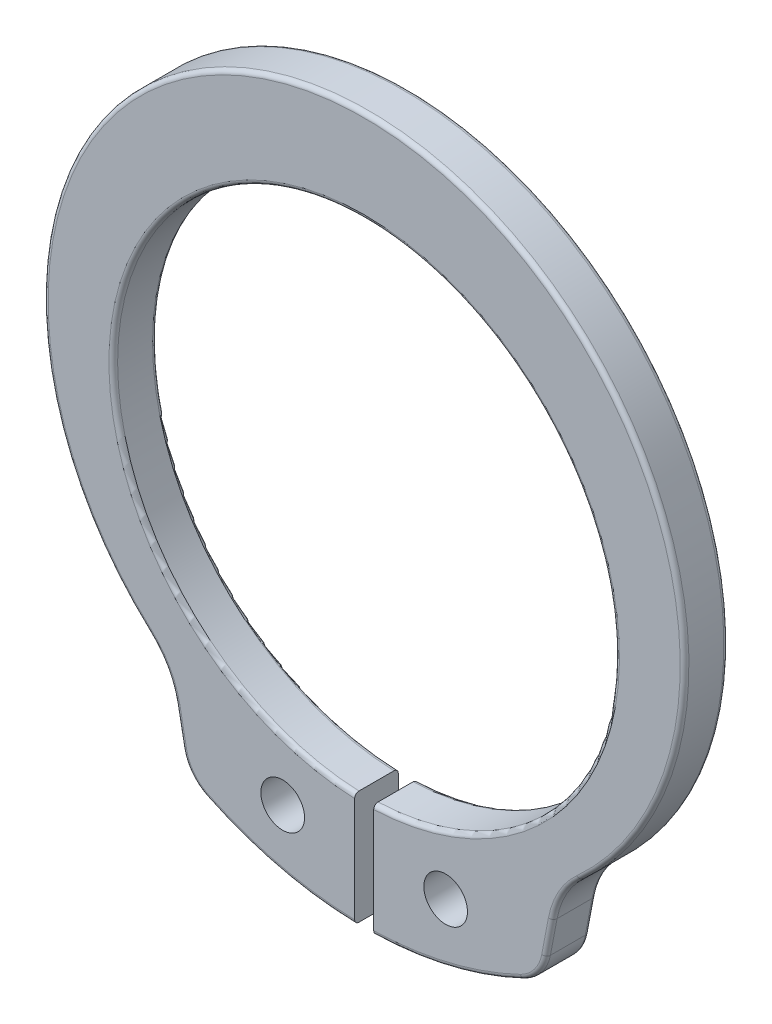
ISO-10303-21;
HEADER;
FILE_DESCRIPTION(('STEP AP214'),'2;1');
FILE_NAME('part.step','',(''),(''),'','','');
FILE_SCHEMA(('AUTOMOTIVE_DESIGN { 1 0 10303 214 1 1 1 1 }'));
ENDSEC;
DATA;
#1=APPLICATION_CONTEXT('core data for automotive mechanical design processes');
#2=APPLICATION_PROTOCOL_DEFINITION('international standard','automotive_design',2000,#1);
#3=PRODUCT_CONTEXT('',#1,'mechanical');
#4=PRODUCT('Part','Part','',(#3));
#5=PRODUCT_RELATED_PRODUCT_CATEGORY('part','',(#4));
#6=PRODUCT_DEFINITION_FORMATION('','',#4);
#7=PRODUCT_DEFINITION_CONTEXT('part definition',#1,'design');
#8=PRODUCT_DEFINITION('design','',#6,#7);
#9=PRODUCT_DEFINITION_SHAPE('','',#8);
#10=(LENGTH_UNIT() NAMED_UNIT(*) SI_UNIT(.MILLI.,.METRE.));
#11=(NAMED_UNIT(*) PLANE_ANGLE_UNIT() SI_UNIT($,.RADIAN.));
#12=(NAMED_UNIT(*) SI_UNIT($,.STERADIAN.) SOLID_ANGLE_UNIT());
#13=UNCERTAINTY_MEASURE_WITH_UNIT(LENGTH_MEASURE(1.E-05),#10,'distance_accuracy_value','');
#14=(GEOMETRIC_REPRESENTATION_CONTEXT(3) GLOBAL_UNCERTAINTY_ASSIGNED_CONTEXT((#13)) GLOBAL_UNIT_ASSIGNED_CONTEXT((#10,
#11,#12)) REPRESENTATION_CONTEXT('',''));
#15=CARTESIAN_POINT('',(0.,0.,0.));
#16=DIRECTION('',(0.,0.,1.));
#17=DIRECTION('',(1.,0.,0.));
#18=AXIS2_PLACEMENT_3D('',#15,#16,#17);
#19=CARTESIAN_POINT('',(0.,0.670296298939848,0.635));
#20=DIRECTION('',(0.,0.,1.));
#21=DIRECTION('',(1.,0.,0.));
#22=AXIS2_PLACEMENT_3D('',#19,#20,#21);
#23=PLANE('',#22);
#24=DIRECTION('',(0.,1.,0.));
#25=VECTOR('',#24,1.);
#26=CARTESIAN_POINT('',(0.277688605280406,-10.6045,0.635));
#27=LINE('',#26,#25);
#28=CARTESIAN_POINT('',(0.277688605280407,-10.4774559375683,0.635));
#29=VERTEX_POINT('',#28);
#30=CARTESIAN_POINT('',(0.277688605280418,-7.42430867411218,0.635));
#31=VERTEX_POINT('',#30);
#32=EDGE_CURVE('E421',#29,#31,#27,.T.);
#33=ORIENTED_EDGE('',*,*,#32,.F.);
#34=CARTESIAN_POINT('',(0.,0.,0.635));
#35=DIRECTION('',(0.,0.,1.));
#36=DIRECTION('',(1.,0.,0.));
#37=AXIS2_PLACEMENT_3D('',#34,#35,#36);
#38=CIRCLE('',#37,10.4811351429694);
#39=CARTESIAN_POINT('',(4.53912560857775,-9.44725000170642,0.635));
#40=VERTEX_POINT('',#39);
#41=EDGE_CURVE('E57',#29,#40,#38,.T.);
#42=ORIENTED_EDGE('',*,*,#41,.T.);
#43=CARTESIAN_POINT('',(4.04412001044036,-8.41699835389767,0.635));
#44=DIRECTION('',(0.,0.,1.));
#45=DIRECTION('',(1.,0.,0.));
#46=AXIS2_PLACEMENT_3D('',#43,#44,#45);
#47=CIRCLE('',#46,1.143);
#48=CARTESIAN_POINT('',(5.16689993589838,-8.63104096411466,0.635));
#49=VERTEX_POINT('',#48);
#50=EDGE_CURVE('E61',#40,#49,#47,.T.);
#51=ORIENTED_EDGE('',*,*,#50,.T.);
#52=DIRECTION('',(-0.187263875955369,-0.982309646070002,0.));
#53=VECTOR('',#52,1.);
#54=CARTESIAN_POINT('',(5.36177125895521,-7.60882576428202,0.635));
#55=LINE('',#54,#53);
#56=CARTESIAN_POINT('',(5.36177125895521,-7.60882576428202,0.635));
#57=VERTEX_POINT('',#56);
#58=EDGE_CURVE('E584',#49,#57,#55,.F.);
#59=ORIENTED_EDGE('',*,*,#58,.T.);
#60=CARTESIAN_POINT('',(7.98159108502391,-8.10825852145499,0.635));
#61=DIRECTION('',(0.,0.,1.));
#62=DIRECTION('',(1.,0.,0.));
#63=AXIS2_PLACEMENT_3D('',#60,#61,#62);
#64=CIRCLE('',#63,2.667);
#65=CARTESIAN_POINT('',(6.18743900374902,-6.13495993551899,0.635));
#66=VERTEX_POINT('',#65);
#67=EDGE_CURVE('E489',#57,#66,#64,.F.);
#68=ORIENTED_EDGE('',*,*,#67,.T.);
#69=CARTESIAN_POINT('',(0.,0.670296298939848,0.635));
#70=DIRECTION('',(0.,0.,1.));
#71=DIRECTION('',(1.,0.,0.));
#72=AXIS2_PLACEMENT_3D('',#69,#70,#71);
#73=CIRCLE('',#72,9.19760370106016);
#74=CARTESIAN_POINT('',(-6.18743900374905,-6.13495993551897,0.635));
#75=VERTEX_POINT('',#74);
#76=EDGE_CURVE('E581',#66,#75,#73,.T.);
#77=ORIENTED_EDGE('',*,*,#76,.T.);
#78=CARTESIAN_POINT('',(-7.98159108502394,-8.10825852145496,0.635));
#79=DIRECTION('',(0.,0.,1.));
#80=DIRECTION('',(1.,0.,0.));
#81=AXIS2_PLACEMENT_3D('',#78,#79,#80);
#82=CIRCLE('',#81,2.667);
#83=CARTESIAN_POINT('',(-5.36177125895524,-7.608825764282,0.635));
#84=VERTEX_POINT('',#83);
#85=EDGE_CURVE('E579',#75,#84,#82,.F.);
#86=ORIENTED_EDGE('',*,*,#85,.T.);
#87=DIRECTION('',(0.187263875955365,-0.982309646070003,0.));
#88=VECTOR('',#87,1.);
#89=CARTESIAN_POINT('',(-5.16689993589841,-8.63104096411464,0.635));
#90=LINE('',#89,#88);
#91=CARTESIAN_POINT('',(-5.16689993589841,-8.63104096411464,0.635));
#92=VERTEX_POINT('',#91);
#93=EDGE_CURVE('E535',#84,#92,#90,.T.);
#94=ORIENTED_EDGE('',*,*,#93,.T.);
#95=CARTESIAN_POINT('',(-4.0441200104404,-8.41699835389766,0.635));
#96=DIRECTION('',(0.,0.,1.));
#97=DIRECTION('',(1.,0.,0.));
#98=AXIS2_PLACEMENT_3D('',#95,#96,#97);
#99=CIRCLE('',#98,1.143);
#100=CARTESIAN_POINT('',(-4.53912560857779,-9.4472500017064,0.635));
#101=VERTEX_POINT('',#100);
#102=EDGE_CURVE('E571',#92,#101,#99,.T.);
#103=ORIENTED_EDGE('',*,*,#102,.T.);
#104=CARTESIAN_POINT('',(0.,0.,0.635));
#105=DIRECTION('',(0.,0.,1.));
#106=DIRECTION('',(1.,0.,0.));
#107=AXIS2_PLACEMENT_3D('',#104,#105,#106);
#108=CIRCLE('',#107,10.4811351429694);
#109=CARTESIAN_POINT('',(-0.277688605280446,-10.4774559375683,0.635));
#110=VERTEX_POINT('',#109);
#111=EDGE_CURVE('E230',#101,#110,#108,.T.);
#112=ORIENTED_EDGE('',*,*,#111,.T.);
#113=DIRECTION('',(0.,1.,0.));
#114=VECTOR('',#113,1.);
#115=CARTESIAN_POINT('',(-0.277688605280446,-10.6045,0.635));
#116=LINE('',#115,#114);
#117=CARTESIAN_POINT('',(-0.277688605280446,-7.42430867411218,0.635));
#118=VERTEX_POINT('',#117);
#119=EDGE_CURVE('E391',#110,#118,#116,.T.);
#120=ORIENTED_EDGE('',*,*,#119,.T.);
#121=CARTESIAN_POINT('',(0.,0.,0.635));
#122=DIRECTION('',(0.,0.,1.));
#123=DIRECTION('',(1.,0.,0.));
#124=AXIS2_PLACEMENT_3D('',#121,#122,#123);
#125=CIRCLE('',#124,7.4295);
#126=EDGE_CURVE('E566',#118,#31,#125,.F.);
#127=ORIENTED_EDGE('',*,*,#126,.T.);
#128=EDGE_LOOP('',(#33,#42,#51,#59,#68,#77,#86,#94,#103,#112,#120,#127));
#129=FACE_BOUND('',#128,.T.);
#130=CARTESIAN_POINT('',(-2.37112029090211,-8.63571082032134,0.635));
#131=DIRECTION('',(0.,0.,1.));
#132=DIRECTION('',(1.,0.,0.));
#133=AXIS2_PLACEMENT_3D('',#130,#131,#132);
#134=CIRCLE('',#133,0.635);
#135=CARTESIAN_POINT('',(-1.73612029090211,-8.63571082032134,0.635));
#136=VERTEX_POINT('',#135);
#137=EDGE_CURVE('E395',#136,#136,#134,.T.);
#138=ORIENTED_EDGE('',*,*,#137,.F.);
#139=EDGE_LOOP('',(#138));
#140=FACE_BOUND('',#139,.T.);
#141=CARTESIAN_POINT('',(2.37112029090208,-8.63571082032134,0.635));
#142=DIRECTION('',(0.,0.,-1.));
#143=DIRECTION('',(-1.,0.,0.));
#144=AXIS2_PLACEMENT_3D('',#141,#142,#143);
#145=CIRCLE('',#144,0.635);
#146=CARTESIAN_POINT('',(1.73612029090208,-8.63571082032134,0.635));
#147=VERTEX_POINT('',#146);
#148=EDGE_CURVE('E425',#147,#147,#145,.T.);
#149=ORIENTED_EDGE('',*,*,#148,.T.);
#150=EDGE_LOOP('',(#149));
#151=FACE_BOUND('',#150,.T.);
#152=ADVANCED_FACE('F39',(#129,#140,#151),#23,.T.);
#153=CARTESIAN_POINT('',(0.,0.670296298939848,-0.635));
#154=DIRECTION('',(0.,0.,1.));
#155=DIRECTION('',(1.,0.,0.));
#156=AXIS2_PLACEMENT_3D('',#153,#154,#155);
#157=PLANE('',#156);
#158=DIRECTION('',(0.,1.,0.));
#159=VECTOR('',#158,1.);
#160=CARTESIAN_POINT('',(-0.277688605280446,-10.6045,-0.635));
#161=LINE('',#160,#159);
#162=CARTESIAN_POINT('',(-0.277688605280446,-10.4774559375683,-0.635));
#163=VERTEX_POINT('',#162);
#164=CARTESIAN_POINT('',(-0.277688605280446,-7.42430867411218,-0.635));
#165=VERTEX_POINT('',#164);
#166=EDGE_CURVE('E392',#163,#165,#161,.T.);
#167=ORIENTED_EDGE('',*,*,#166,.F.);
#168=CARTESIAN_POINT('',(0.,0.,-0.635));
#169=DIRECTION('',(0.,0.,1.));
#170=DIRECTION('',(1.,0.,0.));
#171=AXIS2_PLACEMENT_3D('',#168,#169,#170);
#172=CIRCLE('',#171,10.4811351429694);
#173=CARTESIAN_POINT('',(-4.53912560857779,-9.4472500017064,-0.635));
#174=VERTEX_POINT('',#173);
#175=EDGE_CURVE('E239',#163,#174,#172,.F.);
#176=ORIENTED_EDGE('',*,*,#175,.T.);
#177=CARTESIAN_POINT('',(-4.0441200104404,-8.41699835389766,-0.635));
#178=DIRECTION('',(0.,0.,1.));
#179=DIRECTION('',(1.,0.,0.));
#180=AXIS2_PLACEMENT_3D('',#177,#178,#179);
#181=CIRCLE('',#180,1.143);
#182=CARTESIAN_POINT('',(-5.16689993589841,-8.63104096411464,-0.635));
#183=VERTEX_POINT('',#182);
#184=EDGE_CURVE('E243',#174,#183,#181,.F.);
#185=ORIENTED_EDGE('',*,*,#184,.T.);
#186=DIRECTION('',(0.187263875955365,-0.982309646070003,0.));
#187=VECTOR('',#186,1.);
#188=CARTESIAN_POINT('',(-6.69669966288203,-0.606337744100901,-0.635));
#189=LINE('',#188,#187);
#190=CARTESIAN_POINT('',(-5.36177125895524,-7.608825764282,-0.635));
#191=VERTEX_POINT('',#190);
#192=EDGE_CURVE('E553',#183,#191,#189,.F.);
#193=ORIENTED_EDGE('',*,*,#192,.T.);
#194=CARTESIAN_POINT('',(-7.98159108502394,-8.10825852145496,-0.635));
#195=DIRECTION('',(0.,0.,1.));
#196=DIRECTION('',(1.,0.,0.));
#197=AXIS2_PLACEMENT_3D('',#194,#195,#196);
#198=CIRCLE('',#197,2.667);
#199=CARTESIAN_POINT('',(-6.18743900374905,-6.13495993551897,-0.635));
#200=VERTEX_POINT('',#199);
#201=EDGE_CURVE('E548',#191,#200,#198,.T.);
#202=ORIENTED_EDGE('',*,*,#201,.T.);
#203=CARTESIAN_POINT('',(0.,0.670296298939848,-0.635));
#204=DIRECTION('',(0.,0.,1.));
#205=DIRECTION('',(1.,0.,0.));
#206=AXIS2_PLACEMENT_3D('',#203,#204,#205);
#207=CIRCLE('',#206,9.19760370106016);
#208=CARTESIAN_POINT('',(6.18743900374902,-6.13495993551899,-0.635));
#209=VERTEX_POINT('',#208);
#210=EDGE_CURVE('E626',#200,#209,#207,.F.);
#211=ORIENTED_EDGE('',*,*,#210,.T.);
#212=CARTESIAN_POINT('',(7.98159108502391,-8.10825852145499,-0.635));
#213=DIRECTION('',(0.,0.,1.));
#214=DIRECTION('',(1.,0.,0.));
#215=AXIS2_PLACEMENT_3D('',#212,#213,#214);
#216=CIRCLE('',#215,2.667);
#217=CARTESIAN_POINT('',(5.36177125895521,-7.60882576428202,-0.635));
#218=VERTEX_POINT('',#217);
#219=EDGE_CURVE('E627',#209,#218,#216,.T.);
#220=ORIENTED_EDGE('',*,*,#219,.T.);
#221=DIRECTION('',(-0.187263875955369,-0.982309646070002,0.));
#222=VECTOR('',#221,1.);
#223=CARTESIAN_POINT('',(6.69669966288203,-0.606337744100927,-0.635));
#224=LINE('',#223,#222);
#225=CARTESIAN_POINT('',(5.16689993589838,-8.63104096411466,-0.635));
#226=VERTEX_POINT('',#225);
#227=EDGE_CURVE('E612',#218,#226,#224,.T.);
#228=ORIENTED_EDGE('',*,*,#227,.T.);
#229=CARTESIAN_POINT('',(4.04412001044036,-8.41699835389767,-0.635));
#230=DIRECTION('',(0.,0.,1.));
#231=DIRECTION('',(1.,0.,0.));
#232=AXIS2_PLACEMENT_3D('',#229,#230,#231);
#233=CIRCLE('',#232,1.143);
#234=CARTESIAN_POINT('',(4.53912560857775,-9.44725000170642,-0.635));
#235=VERTEX_POINT('',#234);
#236=EDGE_CURVE('E607',#226,#235,#233,.F.);
#237=ORIENTED_EDGE('',*,*,#236,.T.);
#238=CARTESIAN_POINT('',(0.,0.,-0.635));
#239=DIRECTION('',(0.,0.,1.));
#240=DIRECTION('',(1.,0.,0.));
#241=AXIS2_PLACEMENT_3D('',#238,#239,#240);
#242=CIRCLE('',#241,10.4811351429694);
#243=CARTESIAN_POINT('',(0.277688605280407,-10.4774559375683,-0.635));
#244=VERTEX_POINT('',#243);
#245=EDGE_CURVE('E602',#235,#244,#242,.F.);
#246=ORIENTED_EDGE('',*,*,#245,.T.);
#247=DIRECTION('',(0.,1.,0.));
#248=VECTOR('',#247,1.);
#249=CARTESIAN_POINT('',(0.277688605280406,-10.6045,-0.635));
#250=LINE('',#249,#248);
#251=CARTESIAN_POINT('',(0.277688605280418,-7.42430867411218,-0.635));
#252=VERTEX_POINT('',#251);
#253=EDGE_CURVE('E422',#244,#252,#250,.T.);
#254=ORIENTED_EDGE('',*,*,#253,.T.);
#255=CARTESIAN_POINT('',(0.,0.,-0.635));
#256=DIRECTION('',(0.,0.,1.));
#257=DIRECTION('',(1.,0.,0.));
#258=AXIS2_PLACEMENT_3D('',#255,#256,#257);
#259=CIRCLE('',#258,7.4295);
#260=EDGE_CURVE('E634',#252,#165,#259,.T.);
#261=ORIENTED_EDGE('',*,*,#260,.T.);
#262=EDGE_LOOP('',(#167,#176,#185,#193,#202,#211,#220,#228,#237,#246,#254,#261));
#263=FACE_BOUND('',#262,.T.);
#264=CARTESIAN_POINT('',(-2.37112029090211,-8.63571082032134,-0.635));
#265=DIRECTION('',(0.,0.,1.));
#266=DIRECTION('',(1.,0.,0.));
#267=AXIS2_PLACEMENT_3D('',#264,#265,#266);
#268=CIRCLE('',#267,0.635);
#269=CARTESIAN_POINT('',(-1.73612029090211,-8.63571082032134,-0.635));
#270=VERTEX_POINT('',#269);
#271=EDGE_CURVE('E398',#270,#270,#268,.T.);
#272=ORIENTED_EDGE('',*,*,#271,.T.);
#273=EDGE_LOOP('',(#272));
#274=FACE_BOUND('',#273,.T.);
#275=CARTESIAN_POINT('',(2.37112029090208,-8.63571082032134,-0.635));
#276=DIRECTION('',(0.,0.,-1.));
#277=DIRECTION('',(-1.,0.,0.));
#278=AXIS2_PLACEMENT_3D('',#275,#276,#277);
#279=CIRCLE('',#278,0.635);
#280=CARTESIAN_POINT('',(1.73612029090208,-8.63571082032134,-0.635));
#281=VERTEX_POINT('',#280);
#282=EDGE_CURVE('E428',#281,#281,#279,.T.);
#283=ORIENTED_EDGE('',*,*,#282,.F.);
#284=EDGE_LOOP('',(#283));
#285=FACE_BOUND('',#284,.T.);
#286=ADVANCED_FACE('F441',(#263,#274,#285),#157,.F.);
#287=CARTESIAN_POINT('',(0.,0.670296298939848,0.635));
#288=DIRECTION('',(0.,0.,-1.));
#289=DIRECTION('',(-1.,0.,0.));
#290=AXIS2_PLACEMENT_3D('',#287,#288,#289);
#291=CYLINDRICAL_SURFACE('',#290,9.32460370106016);
#292=DIRECTION('',(0.,0.,-1.));
#293=VECTOR('',#292,1.);
#294=CARTESIAN_POINT('',(6.27287481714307,-6.22892653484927,0.635));
#295=LINE('',#294,#293);
#296=CARTESIAN_POINT('',(6.27287481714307,-6.22892653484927,-0.508));
#297=VERTEX_POINT('',#296);
#298=CARTESIAN_POINT('',(6.27287481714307,-6.22892653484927,0.508));
#299=VERTEX_POINT('',#298);
#300=EDGE_CURVE('E409',#297,#299,#295,.F.);
#301=ORIENTED_EDGE('',*,*,#300,.F.);
#302=CARTESIAN_POINT('',(0.,0.670296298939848,-0.508));
#303=DIRECTION('',(0.,0.,1.));
#304=DIRECTION('',(1.,0.,0.));
#305=AXIS2_PLACEMENT_3D('',#302,#303,#304);
#306=CIRCLE('',#305,9.32460370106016);
#307=CARTESIAN_POINT('',(-6.27287481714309,-6.22892653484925,-0.508));
#308=VERTEX_POINT('',#307);
#309=EDGE_CURVE('E256',#297,#308,#306,.T.);
#310=ORIENTED_EDGE('',*,*,#309,.T.);
#311=DIRECTION('',(0.,0.,-1.));
#312=VECTOR('',#311,1.);
#313=CARTESIAN_POINT('',(-6.27287481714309,-6.22892653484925,0.635));
#314=LINE('',#313,#312);
#315=CARTESIAN_POINT('',(-6.27287481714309,-6.22892653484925,0.508));
#316=VERTEX_POINT('',#315);
#317=EDGE_CURVE('E225',#308,#316,#314,.F.);
#318=ORIENTED_EDGE('',*,*,#317,.T.);
#319=CARTESIAN_POINT('',(0.,0.670296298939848,0.508));
#320=DIRECTION('',(0.,0.,1.));
#321=DIRECTION('',(1.,0.,0.));
#322=AXIS2_PLACEMENT_3D('',#319,#320,#321);
#323=CIRCLE('',#322,9.32460370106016);
#324=EDGE_CURVE('E254',#316,#299,#323,.F.);
#325=ORIENTED_EDGE('',*,*,#324,.T.);
#326=EDGE_LOOP('',(#301,#310,#318,#325));
#327=FACE_BOUND('',#326,.T.);
#328=ADVANCED_FACE('F443',(#327),#291,.T.);
#329=CARTESIAN_POINT('',(-5.17638824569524,-9.25945656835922,0.635));
#330=DIRECTION('',(0.982309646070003,0.187263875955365,0.));
#331=DIRECTION('',(-0.187263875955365,0.982309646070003,0.));
#332=AXIS2_PLACEMENT_3D('',#329,#330,#331);
#333=PLANE('',#332);
#334=DIRECTION('',(0.,0.,1.));
#335=VECTOR('',#334,1.);
#336=CARTESIAN_POINT('',(-5.48652458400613,-7.63260827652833,-0.635));
#337=LINE('',#336,#335);
#338=CARTESIAN_POINT('',(-5.48652458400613,-7.63260827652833,0.508));
#339=VERTEX_POINT('',#338);
#340=CARTESIAN_POINT('',(-5.48652458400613,-7.63260827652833,-0.508));
#341=VERTEX_POINT('',#340);
#342=EDGE_CURVE('E384',#339,#341,#337,.F.);
#343=ORIENTED_EDGE('',*,*,#342,.T.);
#344=DIRECTION('',(0.187263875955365,-0.982309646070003,0.));
#345=VECTOR('',#344,1.);
#346=CARTESIAN_POINT('',(-5.17638824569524,-9.25945656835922,-0.508));
#347=LINE('',#346,#345);
#348=CARTESIAN_POINT('',(-5.2916532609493,-8.65482347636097,-0.508));
#349=VERTEX_POINT('',#348);
#350=EDGE_CURVE('E248',#341,#349,#347,.T.);
#351=ORIENTED_EDGE('',*,*,#350,.T.);
#352=DIRECTION('',(0.,0.,-1.));
#353=VECTOR('',#352,1.);
#354=CARTESIAN_POINT('',(-5.2916532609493,-8.65482347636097,0.635));
#355=LINE('',#354,#353);
#356=CARTESIAN_POINT('',(-5.2916532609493,-8.65482347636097,0.508));
#357=VERTEX_POINT('',#356);
#358=EDGE_CURVE('E215',#349,#357,#355,.F.);
#359=ORIENTED_EDGE('',*,*,#358,.T.);
#360=DIRECTION('',(0.187263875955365,-0.982309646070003,0.));
#361=VECTOR('',#360,1.);
#362=CARTESIAN_POINT('',(-5.48652458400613,-7.63260827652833,0.508));
#363=LINE('',#362,#361);
#364=EDGE_CURVE('E241',#357,#339,#363,.F.);
#365=ORIENTED_EDGE('',*,*,#364,.T.);
#366=EDGE_LOOP('',(#343,#351,#359,#365));
#367=FACE_BOUND('',#366,.T.);
#368=ADVANCED_FACE('F449',(#367),#333,.F.);
#369=CARTESIAN_POINT('',(0.,0.,0.635));
#370=DIRECTION('',(0.,0.,-1.));
#371=DIRECTION('',(-1.,0.,0.));
#372=AXIS2_PLACEMENT_3D('',#369,#370,#371);
#373=CYLINDRICAL_SURFACE('',#372,10.6081351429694);
#374=DIRECTION('',(0.,0.,-1.));
#375=VECTOR('',#374,1.);
#376=CARTESIAN_POINT('',(-4.59412623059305,-9.56172240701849,0.635));
#377=LINE('',#376,#375);
#378=CARTESIAN_POINT('',(-4.59412623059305,-9.56172240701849,0.508));
#379=VERTEX_POINT('',#378);
#380=CARTESIAN_POINT('',(-4.59412623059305,-9.56172240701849,-0.508));
#381=VERTEX_POINT('',#380);
#382=EDGE_CURVE('E207',#379,#381,#377,.T.);
#383=ORIENTED_EDGE('',*,*,#382,.T.);
#384=CARTESIAN_POINT('',(0.,0.,-0.508));
#385=DIRECTION('',(0.,0.,1.));
#386=DIRECTION('',(1.,0.,0.));
#387=AXIS2_PLACEMENT_3D('',#384,#385,#386);
#388=CIRCLE('',#387,10.6081351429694);
#389=CARTESIAN_POINT('',(-0.277688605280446,-10.6045,-0.508));
#390=VERTEX_POINT('',#389);
#391=EDGE_CURVE('E214',#381,#390,#388,.T.);
#392=ORIENTED_EDGE('',*,*,#391,.T.);
#393=DIRECTION('',(0.,0.,-1.));
#394=VECTOR('',#393,1.);
#395=CARTESIAN_POINT('',(-0.277688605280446,-10.6045,0.635));
#396=LINE('',#395,#394);
#397=CARTESIAN_POINT('',(-0.277688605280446,-10.6045,0.508));
#398=VERTEX_POINT('',#397);
#399=EDGE_CURVE('E210',#398,#390,#396,.T.);
#400=ORIENTED_EDGE('',*,*,#399,.F.);
#401=CARTESIAN_POINT('',(0.,0.,0.508));
#402=DIRECTION('',(0.,0.,1.));
#403=DIRECTION('',(1.,0.,0.));
#404=AXIS2_PLACEMENT_3D('',#401,#402,#403);
#405=CIRCLE('',#404,10.6081351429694);
#406=EDGE_CURVE('E203',#398,#379,#405,.F.);
#407=ORIENTED_EDGE('',*,*,#406,.T.);
#408=EDGE_LOOP('',(#383,#392,#400,#407));
#409=FACE_BOUND('',#408,.T.);
#410=ADVANCED_FACE('F205',(#409),#373,.T.);
#411=CARTESIAN_POINT('',(-0.277688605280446,-10.6045,0.635));
#412=DIRECTION('',(-1.,0.,0.));
#413=DIRECTION('',(0.,0.,1.));
#414=AXIS2_PLACEMENT_3D('',#411,#412,#413);
#415=PLANE('',#414);
#416=ORIENTED_EDGE('',*,*,#399,.T.);
#417=CARTESIAN_POINT('',(-0.277688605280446,-10.6045,-0.508));
#418=CARTESIAN_POINT('',(-0.277688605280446,-10.6045060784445,-0.515143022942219));
#419=CARTESIAN_POINT('',(-0.277688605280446,-10.6038975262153,-0.522284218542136));
#420=CARTESIAN_POINT('',(-0.277688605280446,-10.6014960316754,-0.536359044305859));
#421=CARTESIAN_POINT('',(-0.277688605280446,-10.5997040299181,-0.543292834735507));
#422=CARTESIAN_POINT('',(-0.277688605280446,-10.5949792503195,-0.556764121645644));
#423=CARTESIAN_POINT('',(-0.277688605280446,-10.592045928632,-0.56330142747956));
#424=CARTESIAN_POINT('',(-0.277688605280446,-10.5851244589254,-0.575789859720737));
#425=CARTESIAN_POINT('',(-0.277688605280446,-10.5811364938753,-0.581741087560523));
#426=CARTESIAN_POINT('',(-0.277688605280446,-10.572217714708,-0.592890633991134));
#427=CARTESIAN_POINT('',(-0.277688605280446,-10.5672867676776,-0.598088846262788));
#428=CARTESIAN_POINT('',(-0.277688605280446,-10.5566212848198,-0.60758502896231));
#429=CARTESIAN_POINT('',(-0.277688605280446,-10.5508865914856,-0.611882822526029));
#430=CARTESIAN_POINT('',(-0.277688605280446,-10.5387748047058,-0.619456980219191));
#431=CARTESIAN_POINT('',(-0.277688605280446,-10.5323973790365,-0.622732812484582));
#432=CARTESIAN_POINT('',(-0.277688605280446,-10.5191844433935,-0.628165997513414));
#433=CARTESIAN_POINT('',(-0.277688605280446,-10.5123492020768,-0.630323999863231));
#434=CARTESIAN_POINT('',(-0.277688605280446,-10.5008029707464,-0.632925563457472));
#435=CARTESIAN_POINT('',(-0.277688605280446,-10.4961644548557,-0.633703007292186));
#436=CARTESIAN_POINT('',(-0.277688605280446,-10.4868365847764,-0.634740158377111));
#437=CARTESIAN_POINT('',(-0.277688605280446,-10.4821473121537,-0.635000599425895));
#438=CARTESIAN_POINT('',(-0.277688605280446,-10.4774559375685,-0.63500000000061));
#439=B_SPLINE_CURVE_WITH_KNOTS('',3,(#417,#418,#419,#420,#421,#422,#423,#424,#425,#426,#427,
#428,#429,#430,#431,#432,#433,#434,#435,#436,#437,#438),.UNSPECIFIED.,.F.,.F.,(4,2,2,2,2,2,2,2,
2,2,4),(0.,0.0214005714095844,0.0427841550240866,0.0641779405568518,0.0855680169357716,
0.106961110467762,0.128358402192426,0.149766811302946,0.171162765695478,0.185245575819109,
0.199308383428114),.UNSPECIFIED.);
#440=EDGE_CURVE('E349',#390,#163,#439,.T.);
#441=ORIENTED_EDGE('',*,*,#440,.T.);
#442=ORIENTED_EDGE('',*,*,#166,.T.);
#443=CARTESIAN_POINT('',(-0.277688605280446,-7.42430867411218,-0.635));
#444=CARTESIAN_POINT('',(-0.277688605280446,-7.41715513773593,-0.635006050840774));
#445=CARTESIAN_POINT('',(-0.277688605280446,-7.41000338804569,-0.634396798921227));
#446=CARTESIAN_POINT('',(-0.277688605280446,-7.39590747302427,-0.631992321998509));
#447=CARTESIAN_POINT('',(-0.277688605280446,-7.38896315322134,-0.630198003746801));
#448=CARTESIAN_POINT('',(-0.277688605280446,-7.37547128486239,-0.625466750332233));
#449=CARTESIAN_POINT('',(-0.277688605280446,-7.36892393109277,-0.622529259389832));
#450=CARTESIAN_POINT('',(-0.277688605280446,-7.35641659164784,-0.615597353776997));
#451=CARTESIAN_POINT('',(-0.277688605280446,-7.35045649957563,-0.611603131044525));
#452=CARTESIAN_POINT('',(-0.277688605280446,-7.33929370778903,-0.602671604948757));
#453=CARTESIAN_POINT('',(-0.277688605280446,-7.33409077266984,-0.597734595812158));
#454=CARTESIAN_POINT('',(-0.277688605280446,-7.32458722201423,-0.587055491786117));
#455=CARTESIAN_POINT('',(-0.277688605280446,-7.32028678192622,-0.581313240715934));
#456=CARTESIAN_POINT('',(-0.277688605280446,-7.31271407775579,-0.569191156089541));
#457=CARTESIAN_POINT('',(-0.277688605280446,-7.30944132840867,-0.562811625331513));
#458=CARTESIAN_POINT('',(-0.277688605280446,-7.30401582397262,-0.549594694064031));
#459=CARTESIAN_POINT('',(-0.277688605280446,-7.30186240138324,-0.542757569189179));
#460=CARTESIAN_POINT('',(-0.277688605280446,-7.29927510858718,-0.531231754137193));
#461=CARTESIAN_POINT('',(-0.277688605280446,-7.29850428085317,-0.526615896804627));
#462=CARTESIAN_POINT('',(-0.277688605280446,-7.29747595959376,-0.517334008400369));
#463=CARTESIAN_POINT('',(-0.277688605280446,-7.2972177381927,-0.512668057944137));
#464=CARTESIAN_POINT('',(-0.277688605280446,-7.29721832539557,-0.50800000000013));
#465=B_SPLINE_CURVE_WITH_KNOTS('',3,(#443,#444,#445,#446,#447,#448,#449,#450,#451,#452,#453,
#454,#455,#456,#457,#458,#459,#460,#461,#462,#463,#464),.UNSPECIFIED.,.F.,.F.,(4,2,2,2,2,2,2,2,
2,2,4),(0.,0.0214321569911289,0.0428479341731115,0.0642741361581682,0.0856964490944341,
0.107112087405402,0.128531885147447,0.149941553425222,0.17133843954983,0.185351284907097,
0.1993442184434),.UNSPECIFIED.);
#466=CARTESIAN_POINT('',(-0.277688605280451,-7.29721832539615,-0.508));
#467=VERTEX_POINT('',#466);
#468=EDGE_CURVE('E350',#165,#467,#465,.T.);
#469=ORIENTED_EDGE('',*,*,#468,.T.);
#470=DIRECTION('',(0.,0.,-1.));
#471=VECTOR('',#470,1.);
#472=CARTESIAN_POINT('',(-0.277688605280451,-7.29721832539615,0.635));
#473=LINE('',#472,#471);
#474=CARTESIAN_POINT('',(-0.277688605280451,-7.29721832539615,0.508));
#475=VERTEX_POINT('',#474);
#476=EDGE_CURVE('E388',#475,#467,#473,.T.);
#477=ORIENTED_EDGE('',*,*,#476,.F.);
#478=CARTESIAN_POINT('',(-0.277688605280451,-7.29721832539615,0.508));
#479=CARTESIAN_POINT('',(-0.277688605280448,-7.29721223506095,0.515141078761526));
#480=CARTESIAN_POINT('',(-0.277688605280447,-7.29782069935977,0.522280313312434));
#481=CARTESIAN_POINT('',(-0.277688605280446,-7.30022175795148,0.536351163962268));
#482=CARTESIAN_POINT('',(-0.277688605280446,-7.30201339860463,0.543282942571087));
#483=CARTESIAN_POINT('',(-0.277688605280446,-7.3067370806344,0.556750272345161));
#484=CARTESIAN_POINT('',(-0.277688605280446,-7.30966966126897,0.563285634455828));
#485=CARTESIAN_POINT('',(-0.277688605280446,-7.31658915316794,0.575770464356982));
#486=CARTESIAN_POINT('',(-0.277688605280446,-7.32057588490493,0.581720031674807));
#487=CARTESIAN_POINT('',(-0.277688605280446,-7.32949238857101,0.592867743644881));
#488=CARTESIAN_POINT('',(-0.277688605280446,-7.33442245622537,0.598065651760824));
#489=CARTESIAN_POINT('',(-0.277688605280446,-7.34508585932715,0.607561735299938));
#490=CARTESIAN_POINT('',(-0.277688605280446,-7.35081935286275,0.611859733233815));
#491=CARTESIAN_POINT('',(-0.277688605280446,-7.36293064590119,0.619436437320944));
#492=CARTESIAN_POINT('',(-0.277688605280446,-7.36930900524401,0.622714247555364));
#493=CARTESIAN_POINT('',(-0.277688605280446,-7.38252401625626,0.628151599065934));
#494=CARTESIAN_POINT('',(-0.277688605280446,-7.38936040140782,0.630311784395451));
#495=CARTESIAN_POINT('',(-0.277688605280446,-7.40091654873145,0.63291895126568));
#496=CARTESIAN_POINT('',(-0.277688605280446,-7.40556393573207,0.633698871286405));
#497=CARTESIAN_POINT('',(-0.277688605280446,-7.41490979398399,0.634739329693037));
#498=CARTESIAN_POINT('',(-0.277688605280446,-7.41960818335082,0.63500060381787));
#499=CARTESIAN_POINT('',(-0.277688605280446,-7.42430867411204,0.635000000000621));
#500=B_SPLINE_CURVE_WITH_KNOTS('',3,(#478,#479,#480,#481,#482,#483,#484,#485,#486,#487,#488,
#489,#490,#491,#492,#493,#494,#495,#496,#497,#498,#499),.UNSPECIFIED.,.F.,.F.,(4,2,2,2,2,2,2,2,
2,2,4),(0.,0.0213947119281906,0.0427722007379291,0.0641598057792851,0.0855437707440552,
0.106934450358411,0.128329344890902,0.149742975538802,0.171144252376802,0.185254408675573,
0.199344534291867),.UNSPECIFIED.);
#501=EDGE_CURVE('E373',#475,#118,#500,.T.);
#502=ORIENTED_EDGE('',*,*,#501,.T.);
#503=ORIENTED_EDGE('',*,*,#119,.F.);
#504=CARTESIAN_POINT('',(-0.277688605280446,-10.4774559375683,0.635));
#505=CARTESIAN_POINT('',(-0.277688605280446,-10.4846050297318,0.635006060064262));
#506=CARTESIAN_POINT('',(-0.277688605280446,-10.4917523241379,0.634397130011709));
#507=CARTESIAN_POINT('',(-0.277688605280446,-10.5058393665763,0.631993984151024));
#508=CARTESIAN_POINT('',(-0.277688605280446,-10.5127792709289,0.630200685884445));
#509=CARTESIAN_POINT('',(-0.277688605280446,-10.5262625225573,0.625472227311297));
#510=CARTESIAN_POINT('',(-0.277688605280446,-10.532805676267,0.622536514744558));
#511=CARTESIAN_POINT('',(-0.277688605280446,-10.5453050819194,0.615608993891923));
#512=CARTESIAN_POINT('',(-0.277688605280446,-10.5512614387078,0.611617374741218));
#513=CARTESIAN_POINT('',(-0.277688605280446,-10.5624183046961,0.60269128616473));
#514=CARTESIAN_POINT('',(-0.277688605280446,-10.5676189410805,0.597756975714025));
#515=CARTESIAN_POINT('',(-0.277688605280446,-10.5771187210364,0.58708388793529));
#516=CARTESIAN_POINT('',(-0.277688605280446,-10.5814176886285,0.581344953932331));
#517=CARTESIAN_POINT('',(-0.277688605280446,-10.5889898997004,0.569227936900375));
#518=CARTESIAN_POINT('',(-0.277688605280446,-10.5922632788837,0.562849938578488));
#519=CARTESIAN_POINT('',(-0.277688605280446,-10.597690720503,0.54963606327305));
#520=CARTESIAN_POINT('',(-0.277688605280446,-10.599845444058,0.542800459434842));
#521=CARTESIAN_POINT('',(-0.277688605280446,-10.6024373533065,0.531268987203));
#522=CARTESIAN_POINT('',(-0.277688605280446,-10.6032103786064,0.52664581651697));
#523=CARTESIAN_POINT('',(-0.277688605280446,-10.6042416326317,0.517349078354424));
#524=CARTESIAN_POINT('',(-0.277688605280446,-10.6045005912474,0.512675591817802));
#525=CARTESIAN_POINT('',(-0.277688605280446,-10.6045000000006,0.508000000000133));
#526=B_SPLINE_CURVE_WITH_KNOTS('',3,(#504,#505,#506,#507,#508,#509,#510,#511,#512,#513,#514,
#515,#516,#517,#518,#519,#520,#521,#522,#523,#524,#525),.UNSPECIFIED.,.F.,.F.,(4,2,2,2,2,2,2,2,
2,2,4),(0.,0.0214188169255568,0.0428210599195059,0.0642336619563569,0.0856424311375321,
0.107047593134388,0.128456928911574,0.149863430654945,0.171257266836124,0.185292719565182,
0.19930822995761),.UNSPECIFIED.);
#527=EDGE_CURVE('E341',#110,#398,#526,.T.);
#528=ORIENTED_EDGE('',*,*,#527,.T.);
#529=EDGE_LOOP('',(#416,#441,#442,#469,#477,#502,#503,#528));
#530=FACE_BOUND('',#529,.T.);
#531=ADVANCED_FACE('F362',(#530),#415,.F.);
#532=CARTESIAN_POINT('',(0.,0.,0.635));
#533=DIRECTION('',(0.,0.,-1.));
#534=DIRECTION('',(-1.,0.,0.));
#535=AXIS2_PLACEMENT_3D('',#532,#533,#534);
#536=CYLINDRICAL_SURFACE('',#535,7.3025);
#537=ORIENTED_EDGE('',*,*,#476,.T.);
#538=CARTESIAN_POINT('',(0.,0.,-0.508));
#539=DIRECTION('',(0.,0.,1.));
#540=DIRECTION('',(1.,0.,0.));
#541=AXIS2_PLACEMENT_3D('',#538,#539,#540);
#542=CIRCLE('',#541,7.3025);
#543=CARTESIAN_POINT('',(0.277688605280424,-7.29721832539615,-0.508));
#544=VERTEX_POINT('',#543);
#545=EDGE_CURVE('E12',#467,#544,#542,.F.);
#546=ORIENTED_EDGE('',*,*,#545,.T.);
#547=DIRECTION('',(0.,0.,-1.));
#548=VECTOR('',#547,1.);
#549=CARTESIAN_POINT('',(0.277688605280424,-7.29721832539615,0.635));
#550=LINE('',#549,#548);
#551=CARTESIAN_POINT('',(0.277688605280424,-7.29721832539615,0.508));
#552=VERTEX_POINT('',#551);
#553=EDGE_CURVE('E418',#552,#544,#550,.T.);
#554=ORIENTED_EDGE('',*,*,#553,.F.);
#555=CARTESIAN_POINT('',(0.,0.,0.508));
#556=DIRECTION('',(0.,0.,1.));
#557=DIRECTION('',(1.,0.,0.));
#558=AXIS2_PLACEMENT_3D('',#555,#556,#557);
#559=CIRCLE('',#558,7.3025);
#560=EDGE_CURVE('E49',#552,#475,#559,.T.);
#561=ORIENTED_EDGE('',*,*,#560,.T.);
#562=EDGE_LOOP('',(#537,#546,#554,#561));
#563=FACE_BOUND('',#562,.T.);
#564=ADVANCED_FACE('F367',(#563),#536,.F.);
#565=CARTESIAN_POINT('',(-2.37112029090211,-8.63571082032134,0.635));
#566=DIRECTION('',(0.,0.,-1.));
#567=DIRECTION('',(-1.,0.,0.));
#568=AXIS2_PLACEMENT_3D('',#565,#566,#567);
#569=CYLINDRICAL_SURFACE('',#568,0.635);
#570=ORIENTED_EDGE('',*,*,#137,.T.);
#571=EDGE_LOOP('',(#570));
#572=FACE_BOUND('',#571,.T.);
#573=ORIENTED_EDGE('',*,*,#271,.F.);
#574=EDGE_LOOP('',(#573));
#575=FACE_BOUND('',#574,.T.);
#576=ADVANCED_FACE('F456',(#572,#575),#569,.F.);
#577=CARTESIAN_POINT('',(-7.98159108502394,-8.10825852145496,0.635));
#578=DIRECTION('',(0.,0.,-1.));
#579=DIRECTION('',(-1.,0.,0.));
#580=AXIS2_PLACEMENT_3D('',#577,#578,#579);
#581=CYLINDRICAL_SURFACE('',#580,2.54);
#582=ORIENTED_EDGE('',*,*,#317,.F.);
#583=CARTESIAN_POINT('',(-7.98159108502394,-8.10825852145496,-0.508));
#584=DIRECTION('',(0.,0.,1.));
#585=DIRECTION('',(1.,0.,0.));
#586=AXIS2_PLACEMENT_3D('',#583,#584,#585);
#587=CIRCLE('',#586,2.54);
#588=EDGE_CURVE('E252',#308,#341,#587,.F.);
#589=ORIENTED_EDGE('',*,*,#588,.T.);
#590=ORIENTED_EDGE('',*,*,#342,.F.);
#591=CARTESIAN_POINT('',(-7.98159108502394,-8.10825852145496,0.508));
#592=DIRECTION('',(0.,0.,1.));
#593=DIRECTION('',(1.,0.,0.));
#594=AXIS2_PLACEMENT_3D('',#591,#592,#593);
#595=CIRCLE('',#594,2.54);
#596=EDGE_CURVE('E250',#339,#316,#595,.T.);
#597=ORIENTED_EDGE('',*,*,#596,.T.);
#598=EDGE_LOOP('',(#582,#589,#590,#597));
#599=FACE_BOUND('',#598,.T.);
#600=ADVANCED_FACE('F459',(#599),#581,.F.);
#601=CARTESIAN_POINT('',(-4.0441200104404,-8.41699835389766,0.635));
#602=DIRECTION('',(0.,0.,-1.));
#603=DIRECTION('',(-1.,0.,0.));
#604=AXIS2_PLACEMENT_3D('',#601,#602,#603);
#605=CYLINDRICAL_SURFACE('',#604,1.27);
#606=ORIENTED_EDGE('',*,*,#358,.F.);
#607=CARTESIAN_POINT('',(-4.0441200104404,-8.41699835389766,-0.508));
#608=DIRECTION('',(0.,0.,1.));
#609=DIRECTION('',(1.,0.,0.));
#610=AXIS2_PLACEMENT_3D('',#607,#608,#609);
#611=CIRCLE('',#610,1.27);
#612=EDGE_CURVE('E224',#349,#381,#611,.T.);
#613=ORIENTED_EDGE('',*,*,#612,.T.);
#614=ORIENTED_EDGE('',*,*,#382,.F.);
#615=CARTESIAN_POINT('',(-4.0441200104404,-8.41699835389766,0.508));
#616=DIRECTION('',(0.,0.,1.));
#617=DIRECTION('',(1.,0.,0.));
#618=AXIS2_PLACEMENT_3D('',#615,#616,#617);
#619=CIRCLE('',#618,1.27);
#620=EDGE_CURVE('E221',#379,#357,#619,.F.);
#621=ORIENTED_EDGE('',*,*,#620,.T.);
#622=EDGE_LOOP('',(#606,#613,#614,#621));
#623=FACE_BOUND('',#622,.T.);
#624=ADVANCED_FACE('F219',(#623),#605,.T.);
#625=CARTESIAN_POINT('',(5.1763882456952,-9.25945656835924,0.635));
#626=DIRECTION('',(-0.982309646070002,0.187263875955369,0.));
#627=DIRECTION('',(0.187263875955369,0.982309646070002,0.));
#628=AXIS2_PLACEMENT_3D('',#625,#626,#627);
#629=PLANE('',#628);
#630=DIRECTION('',(0.,0.,1.));
#631=VECTOR('',#630,1.);
#632=CARTESIAN_POINT('',(5.4865245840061,-7.63260827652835,-0.635));
#633=LINE('',#632,#631);
#634=CARTESIAN_POINT('',(5.4865245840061,-7.63260827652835,0.508));
#635=VERTEX_POINT('',#634);
#636=CARTESIAN_POINT('',(5.4865245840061,-7.63260827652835,-0.508));
#637=VERTEX_POINT('',#636);
#638=EDGE_CURVE('E412',#635,#637,#633,.F.);
#639=ORIENTED_EDGE('',*,*,#638,.F.);
#640=DIRECTION('',(-0.187263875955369,-0.982309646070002,0.));
#641=VECTOR('',#640,1.);
#642=CARTESIAN_POINT('',(5.29165326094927,-8.65482347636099,0.508));
#643=LINE('',#642,#641);
#644=CARTESIAN_POINT('',(5.29165326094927,-8.65482347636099,0.508));
#645=VERTEX_POINT('',#644);
#646=EDGE_CURVE('E480',#635,#645,#643,.T.);
#647=ORIENTED_EDGE('',*,*,#646,.T.);
#648=DIRECTION('',(0.,0.,-1.));
#649=VECTOR('',#648,1.);
#650=CARTESIAN_POINT('',(5.29165326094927,-8.65482347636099,0.635));
#651=LINE('',#650,#649);
#652=CARTESIAN_POINT('',(5.29165326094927,-8.65482347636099,-0.508));
#653=VERTEX_POINT('',#652);
#654=EDGE_CURVE('E401',#653,#645,#651,.F.);
#655=ORIENTED_EDGE('',*,*,#654,.F.);
#656=DIRECTION('',(-0.187263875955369,-0.982309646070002,0.));
#657=VECTOR('',#656,1.);
#658=CARTESIAN_POINT('',(5.1763882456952,-9.25945656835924,-0.508));
#659=LINE('',#658,#657);
#660=EDGE_CURVE('E482',#653,#637,#659,.F.);
#661=ORIENTED_EDGE('',*,*,#660,.T.);
#662=EDGE_LOOP('',(#639,#647,#655,#661));
#663=FACE_BOUND('',#662,.T.);
#664=ADVANCED_FACE('F467',(#663),#629,.F.);
#665=CARTESIAN_POINT('',(0.,0.,0.635));
#666=DIRECTION('',(0.,0.,-1.));
#667=DIRECTION('',(1.,0.,0.));
#668=AXIS2_PLACEMENT_3D('',#665,#666,#667);
#669=CYLINDRICAL_SURFACE('',#668,10.6081351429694);
#670=DIRECTION('',(0.,0.,-1.));
#671=VECTOR('',#670,1.);
#672=CARTESIAN_POINT('',(0.277688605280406,-10.6045,0.635));
#673=LINE('',#672,#671);
#674=CARTESIAN_POINT('',(0.277688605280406,-10.6045,0.508));
#675=VERTEX_POINT('',#674);
#676=CARTESIAN_POINT('',(0.277688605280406,-10.6045,-0.508));
#677=VERTEX_POINT('',#676);
#678=EDGE_CURVE('E415',#675,#677,#673,.T.);
#679=ORIENTED_EDGE('',*,*,#678,.T.);
#680=CARTESIAN_POINT('',(0.,0.,-0.508));
#681=DIRECTION('',(0.,0.,1.));
#682=DIRECTION('',(1.,0.,0.));
#683=AXIS2_PLACEMENT_3D('',#680,#681,#682);
#684=CIRCLE('',#683,10.6081351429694);
#685=CARTESIAN_POINT('',(4.59412623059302,-9.56172240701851,-0.508));
#686=VERTEX_POINT('',#685);
#687=EDGE_CURVE('E590',#677,#686,#684,.T.);
#688=ORIENTED_EDGE('',*,*,#687,.T.);
#689=DIRECTION('',(0.,0.,-1.));
#690=VECTOR('',#689,1.);
#691=CARTESIAN_POINT('',(4.59412623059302,-9.56172240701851,0.635));
#692=LINE('',#691,#690);
#693=CARTESIAN_POINT('',(4.59412623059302,-9.56172240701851,0.508));
#694=VERTEX_POINT('',#693);
#695=EDGE_CURVE('E406',#694,#686,#692,.T.);
#696=ORIENTED_EDGE('',*,*,#695,.F.);
#697=CARTESIAN_POINT('',(0.,0.,0.508));
#698=DIRECTION('',(0.,0.,1.));
#699=DIRECTION('',(1.,0.,0.));
#700=AXIS2_PLACEMENT_3D('',#697,#698,#699);
#701=CIRCLE('',#700,10.6081351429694);
#702=EDGE_CURVE('E591',#694,#675,#701,.F.);
#703=ORIENTED_EDGE('',*,*,#702,.T.);
#704=EDGE_LOOP('',(#679,#688,#696,#703));
#705=FACE_BOUND('',#704,.T.);
#706=ADVANCED_FACE('F281',(#705),#669,.T.);
#707=CARTESIAN_POINT('',(0.277688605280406,-10.6045,0.635));
#708=DIRECTION('',(1.,0.,0.));
#709=DIRECTION('',(0.,0.,1.));
#710=AXIS2_PLACEMENT_3D('',#707,#708,#709);
#711=PLANE('',#710);
#712=ORIENTED_EDGE('',*,*,#253,.F.);
#713=CARTESIAN_POINT('',(0.277688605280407,-10.4774559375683,-0.635));
#714=CARTESIAN_POINT('',(0.277688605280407,-10.4846050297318,-0.635006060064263));
#715=CARTESIAN_POINT('',(0.277688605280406,-10.4917523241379,-0.634397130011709));
#716=CARTESIAN_POINT('',(0.277688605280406,-10.5058393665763,-0.631993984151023));
#717=CARTESIAN_POINT('',(0.277688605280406,-10.5127792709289,-0.630200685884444));
#718=CARTESIAN_POINT('',(0.277688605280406,-10.5262625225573,-0.625472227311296));
#719=CARTESIAN_POINT('',(0.277688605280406,-10.532805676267,-0.622536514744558));
#720=CARTESIAN_POINT('',(0.277688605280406,-10.5453050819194,-0.615608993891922));
#721=CARTESIAN_POINT('',(0.277688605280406,-10.5512614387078,-0.611617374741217));
#722=CARTESIAN_POINT('',(0.277688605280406,-10.5624183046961,-0.60269128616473));
#723=CARTESIAN_POINT('',(0.277688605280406,-10.5676189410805,-0.597756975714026));
#724=CARTESIAN_POINT('',(0.277688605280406,-10.5771187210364,-0.587083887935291));
#725=CARTESIAN_POINT('',(0.277688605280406,-10.5814176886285,-0.581344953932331));
#726=CARTESIAN_POINT('',(0.277688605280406,-10.5889898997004,-0.569227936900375));
#727=CARTESIAN_POINT('',(0.277688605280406,-10.5922632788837,-0.562849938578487));
#728=CARTESIAN_POINT('',(0.277688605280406,-10.597690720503,-0.54963606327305));
#729=CARTESIAN_POINT('',(0.277688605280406,-10.599845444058,-0.542800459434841));
#730=CARTESIAN_POINT('',(0.277688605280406,-10.6024373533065,-0.531268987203));
#731=CARTESIAN_POINT('',(0.277688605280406,-10.6032103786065,-0.526645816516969));
#732=CARTESIAN_POINT('',(0.277688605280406,-10.6042416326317,-0.517349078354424));
#733=CARTESIAN_POINT('',(0.277688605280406,-10.6045005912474,-0.512675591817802));
#734=CARTESIAN_POINT('',(0.277688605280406,-10.6045000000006,-0.508000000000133));
#735=B_SPLINE_CURVE_WITH_KNOTS('',3,(#713,#714,#715,#716,#717,#718,#719,#720,#721,#722,#723,
#724,#725,#726,#727,#728,#729,#730,#731,#732,#733,#734),.UNSPECIFIED.,.F.,.F.,(4,2,2,2,2,2,2,2,
2,2,4),(0.,0.0214188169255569,0.042821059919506,0.0642336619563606,0.0856424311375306,
0.107047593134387,0.128456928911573,0.149863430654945,0.171257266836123,0.185292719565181,
0.199308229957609),.UNSPECIFIED.);
#736=EDGE_CURVE('E294',#244,#677,#735,.T.);
#737=ORIENTED_EDGE('',*,*,#736,.T.);
#738=ORIENTED_EDGE('',*,*,#678,.F.);
#739=CARTESIAN_POINT('',(0.277688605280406,-10.6045,0.508));
#740=CARTESIAN_POINT('',(0.277688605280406,-10.6045060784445,0.515143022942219));
#741=CARTESIAN_POINT('',(0.277688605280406,-10.6038975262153,0.522284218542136));
#742=CARTESIAN_POINT('',(0.277688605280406,-10.6014960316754,0.536359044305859));
#743=CARTESIAN_POINT('',(0.277688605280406,-10.5997040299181,0.543292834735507));
#744=CARTESIAN_POINT('',(0.277688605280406,-10.5949792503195,0.556764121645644));
#745=CARTESIAN_POINT('',(0.277688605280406,-10.592045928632,0.56330142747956));
#746=CARTESIAN_POINT('',(0.277688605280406,-10.5851244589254,0.575789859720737));
#747=CARTESIAN_POINT('',(0.277688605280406,-10.5811364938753,0.581741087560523));
#748=CARTESIAN_POINT('',(0.277688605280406,-10.572217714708,0.592890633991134));
#749=CARTESIAN_POINT('',(0.277688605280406,-10.5672867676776,0.598088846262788));
#750=CARTESIAN_POINT('',(0.277688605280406,-10.5566212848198,0.60758502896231));
#751=CARTESIAN_POINT('',(0.277688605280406,-10.5508865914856,0.611882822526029));
#752=CARTESIAN_POINT('',(0.277688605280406,-10.5387748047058,0.619456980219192));
#753=CARTESIAN_POINT('',(0.277688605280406,-10.5323973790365,0.622732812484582));
#754=CARTESIAN_POINT('',(0.277688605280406,-10.5191844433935,0.628165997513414));
#755=CARTESIAN_POINT('',(0.277688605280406,-10.5123492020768,0.630323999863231));
#756=CARTESIAN_POINT('',(0.277688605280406,-10.5008029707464,0.632925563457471));
#757=CARTESIAN_POINT('',(0.277688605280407,-10.4961644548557,0.633703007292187));
#758=CARTESIAN_POINT('',(0.277688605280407,-10.4868365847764,0.634740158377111));
#759=CARTESIAN_POINT('',(0.277688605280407,-10.4821473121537,0.635000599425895));
#760=CARTESIAN_POINT('',(0.277688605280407,-10.4774559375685,0.63500000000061));
#761=B_SPLINE_CURVE_WITH_KNOTS('',3,(#739,#740,#741,#742,#743,#744,#745,#746,#747,#748,#749,
#750,#751,#752,#753,#754,#755,#756,#757,#758,#759,#760),.UNSPECIFIED.,.F.,.F.,(4,2,2,2,2,2,2,2,
2,2,4),(0.,0.0214005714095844,0.0427841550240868,0.064177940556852,0.0855680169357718,
0.106961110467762,0.128358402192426,0.149766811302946,0.171162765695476,0.185245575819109,
0.199308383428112),.UNSPECIFIED.);
#762=EDGE_CURVE('E288',#675,#29,#761,.T.);
#763=ORIENTED_EDGE('',*,*,#762,.T.);
#764=ORIENTED_EDGE('',*,*,#32,.T.);
#765=CARTESIAN_POINT('',(0.277688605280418,-7.42430867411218,0.635));
#766=CARTESIAN_POINT('',(0.277688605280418,-7.41715513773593,0.635006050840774));
#767=CARTESIAN_POINT('',(0.277688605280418,-7.41000338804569,0.634396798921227));
#768=CARTESIAN_POINT('',(0.277688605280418,-7.39590747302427,0.631992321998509));
#769=CARTESIAN_POINT('',(0.277688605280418,-7.38896315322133,0.6301980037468));
#770=CARTESIAN_POINT('',(0.277688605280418,-7.37547128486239,0.625466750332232));
#771=CARTESIAN_POINT('',(0.277688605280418,-7.36892393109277,0.62252925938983));
#772=CARTESIAN_POINT('',(0.277688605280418,-7.35641659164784,0.615597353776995));
#773=CARTESIAN_POINT('',(0.277688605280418,-7.35045649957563,0.611603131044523));
#774=CARTESIAN_POINT('',(0.277688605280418,-7.33929370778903,0.602671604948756));
#775=CARTESIAN_POINT('',(0.277688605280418,-7.33409077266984,0.597734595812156));
#776=CARTESIAN_POINT('',(0.277688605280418,-7.32458722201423,0.587055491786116));
#777=CARTESIAN_POINT('',(0.277688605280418,-7.32028678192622,0.581313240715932));
#778=CARTESIAN_POINT('',(0.277688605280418,-7.31271407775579,0.56919115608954));
#779=CARTESIAN_POINT('',(0.277688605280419,-7.30944132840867,0.562811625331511));
#780=CARTESIAN_POINT('',(0.277688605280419,-7.30401582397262,0.54959469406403));
#781=CARTESIAN_POINT('',(0.277688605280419,-7.30186240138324,0.542757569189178));
#782=CARTESIAN_POINT('',(0.277688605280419,-7.29927510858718,0.531231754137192));
#783=CARTESIAN_POINT('',(0.277688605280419,-7.29850428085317,0.526615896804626));
#784=CARTESIAN_POINT('',(0.277688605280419,-7.29747595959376,0.517334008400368));
#785=CARTESIAN_POINT('',(0.277688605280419,-7.2972177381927,0.512668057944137));
#786=CARTESIAN_POINT('',(0.277688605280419,-7.29721832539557,0.50800000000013));
#787=B_SPLINE_CURVE_WITH_KNOTS('',3,(#765,#766,#767,#768,#769,#770,#771,#772,#773,#774,#775,
#776,#777,#778,#779,#780,#781,#782,#783,#784,#785,#786),.UNSPECIFIED.,.F.,.F.,(4,2,2,2,2,2,2,2,
2,2,4),(0.,0.0214321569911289,0.0428479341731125,0.0642741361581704,0.0856964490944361,
0.107112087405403,0.128531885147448,0.149941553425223,0.171338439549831,0.185351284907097,
0.199344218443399),.UNSPECIFIED.);
#788=EDGE_CURVE('E262',#31,#552,#787,.T.);
#789=ORIENTED_EDGE('',*,*,#788,.T.);
#790=ORIENTED_EDGE('',*,*,#553,.T.);
#791=CARTESIAN_POINT('',(0.277688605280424,-7.29721832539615,-0.508));
#792=CARTESIAN_POINT('',(0.27768860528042,-7.29721223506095,-0.515141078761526));
#793=CARTESIAN_POINT('',(0.277688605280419,-7.29782069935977,-0.522280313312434));
#794=CARTESIAN_POINT('',(0.277688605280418,-7.30022175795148,-0.536351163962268));
#795=CARTESIAN_POINT('',(0.277688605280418,-7.30201339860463,-0.543282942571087));
#796=CARTESIAN_POINT('',(0.277688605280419,-7.3067370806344,-0.556750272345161));
#797=CARTESIAN_POINT('',(0.277688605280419,-7.30966966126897,-0.563285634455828));
#798=CARTESIAN_POINT('',(0.277688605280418,-7.31658915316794,-0.575770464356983));
#799=CARTESIAN_POINT('',(0.277688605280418,-7.32057588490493,-0.581720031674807));
#800=CARTESIAN_POINT('',(0.277688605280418,-7.32949238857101,-0.592867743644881));
#801=CARTESIAN_POINT('',(0.277688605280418,-7.33442245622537,-0.598065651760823));
#802=CARTESIAN_POINT('',(0.277688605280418,-7.34508585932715,-0.607561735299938));
#803=CARTESIAN_POINT('',(0.277688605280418,-7.35081935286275,-0.611859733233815));
#804=CARTESIAN_POINT('',(0.277688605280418,-7.36293064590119,-0.619436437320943));
#805=CARTESIAN_POINT('',(0.277688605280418,-7.36930900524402,-0.622714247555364));
#806=CARTESIAN_POINT('',(0.277688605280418,-7.38252401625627,-0.628151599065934));
#807=CARTESIAN_POINT('',(0.277688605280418,-7.38936040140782,-0.63031178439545));
#808=CARTESIAN_POINT('',(0.277688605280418,-7.40091654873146,-0.63291895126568));
#809=CARTESIAN_POINT('',(0.277688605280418,-7.40556393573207,-0.633698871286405));
#810=CARTESIAN_POINT('',(0.277688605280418,-7.41490979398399,-0.634739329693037));
#811=CARTESIAN_POINT('',(0.277688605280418,-7.41960818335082,-0.63500060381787));
#812=CARTESIAN_POINT('',(0.277688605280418,-7.42430867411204,-0.635000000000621));
#813=B_SPLINE_CURVE_WITH_KNOTS('',3,(#791,#792,#793,#794,#795,#796,#797,#798,#799,#800,#801,
#802,#803,#804,#805,#806,#807,#808,#809,#810,#811,#812),.UNSPECIFIED.,.F.,.F.,(4,2,2,2,2,2,2,2,
2,2,4),(0.,0.0213947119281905,0.0427722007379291,0.0641598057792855,0.0855437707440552,
0.106934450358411,0.128329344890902,0.149742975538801,0.171144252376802,0.185254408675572,
0.199344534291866),.UNSPECIFIED.);
#814=EDGE_CURVE('E269',#544,#252,#813,.T.);
#815=ORIENTED_EDGE('',*,*,#814,.T.);
#816=EDGE_LOOP('',(#712,#737,#738,#763,#764,#789,#790,#815));
#817=FACE_BOUND('',#816,.T.);
#818=ADVANCED_FACE('F275',(#817),#711,.F.);
#819=CARTESIAN_POINT('',(2.37112029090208,-8.63571082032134,0.635));
#820=DIRECTION('',(0.,0.,-1.));
#821=DIRECTION('',(1.,0.,0.));
#822=AXIS2_PLACEMENT_3D('',#819,#820,#821);
#823=CYLINDRICAL_SURFACE('',#822,0.635);
#824=ORIENTED_EDGE('',*,*,#148,.F.);
#825=EDGE_LOOP('',(#824));
#826=FACE_BOUND('',#825,.T.);
#827=ORIENTED_EDGE('',*,*,#282,.T.);
#828=EDGE_LOOP('',(#827));
#829=FACE_BOUND('',#828,.T.);
#830=ADVANCED_FACE('F280',(#826,#829),#823,.F.);
#831=CARTESIAN_POINT('',(7.98159108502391,-8.10825852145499,0.635));
#832=DIRECTION('',(0.,0.,-1.));
#833=DIRECTION('',(1.,0.,0.));
#834=AXIS2_PLACEMENT_3D('',#831,#832,#833);
#835=CYLINDRICAL_SURFACE('',#834,2.54);
#836=ORIENTED_EDGE('',*,*,#638,.T.);
#837=CARTESIAN_POINT('',(7.98159108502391,-8.10825852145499,-0.508));
#838=DIRECTION('',(0.,0.,1.));
#839=DIRECTION('',(1.,0.,0.));
#840=AXIS2_PLACEMENT_3D('',#837,#838,#839);
#841=CIRCLE('',#840,2.54);
#842=EDGE_CURVE('E260',#637,#297,#841,.F.);
#843=ORIENTED_EDGE('',*,*,#842,.T.);
#844=ORIENTED_EDGE('',*,*,#300,.T.);
#845=CARTESIAN_POINT('',(7.98159108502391,-8.10825852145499,0.508));
#846=DIRECTION('',(0.,0.,1.));
#847=DIRECTION('',(1.,0.,0.));
#848=AXIS2_PLACEMENT_3D('',#845,#846,#847);
#849=CIRCLE('',#848,2.54);
#850=EDGE_CURVE('E258',#299,#635,#849,.T.);
#851=ORIENTED_EDGE('',*,*,#850,.T.);
#852=EDGE_LOOP('',(#836,#843,#844,#851));
#853=FACE_BOUND('',#852,.T.);
#854=ADVANCED_FACE('F438',(#853),#835,.F.);
#855=CARTESIAN_POINT('',(4.04412001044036,-8.41699835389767,0.635));
#856=DIRECTION('',(0.,0.,-1.));
#857=DIRECTION('',(1.,0.,0.));
#858=AXIS2_PLACEMENT_3D('',#855,#856,#857);
#859=CYLINDRICAL_SURFACE('',#858,1.27);
#860=ORIENTED_EDGE('',*,*,#695,.T.);
#861=CARTESIAN_POINT('',(4.04412001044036,-8.41699835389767,-0.508));
#862=DIRECTION('',(0.,0.,1.));
#863=DIRECTION('',(1.,0.,0.));
#864=AXIS2_PLACEMENT_3D('',#861,#862,#863);
#865=CIRCLE('',#864,1.27);
#866=EDGE_CURVE('E569',#686,#653,#865,.T.);
#867=ORIENTED_EDGE('',*,*,#866,.T.);
#868=ORIENTED_EDGE('',*,*,#654,.T.);
#869=CARTESIAN_POINT('',(4.04412001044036,-8.41699835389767,0.508));
#870=DIRECTION('',(0.,0.,1.));
#871=DIRECTION('',(1.,0.,0.));
#872=AXIS2_PLACEMENT_3D('',#869,#870,#871);
#873=CIRCLE('',#872,1.27);
#874=EDGE_CURVE('E573',#645,#694,#873,.F.);
#875=ORIENTED_EDGE('',*,*,#874,.T.);
#876=EDGE_LOOP('',(#860,#867,#868,#875));
#877=FACE_BOUND('',#876,.T.);
#878=ADVANCED_FACE('F461',(#877),#859,.T.);
#879=CARTESIAN_POINT('',(0.,0.,-0.508));
#880=DIRECTION('',(0.,0.,1.));
#881=DIRECTION('',(1.,0.,0.));
#882=AXIS2_PLACEMENT_3D('',#879,#880,#881);
#883=TOROIDAL_SURFACE('',#882,10.4811351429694,0.127);
#884=ORIENTED_EDGE('',*,*,#736,.F.);
#885=ORIENTED_EDGE('',*,*,#245,.F.);
#886=CARTESIAN_POINT('',(4.53912560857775,-9.44725000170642,-0.508));
#887=DIRECTION('',(0.90135752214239,0.433075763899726,0.));
#888=DIRECTION('',(-0.433075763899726,0.90135752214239,0.));
#889=AXIS2_PLACEMENT_3D('',#886,#887,#888);
#890=CIRCLE('',#889,0.127);
#891=EDGE_CURVE('E431',#686,#235,#890,.T.);
#892=ORIENTED_EDGE('',*,*,#891,.F.);
#893=ORIENTED_EDGE('',*,*,#687,.F.);
#894=EDGE_LOOP('',(#884,#885,#892,#893));
#895=FACE_BOUND('',#894,.T.);
#896=ADVANCED_FACE('F308',(#895),#883,.T.);
#897=CARTESIAN_POINT('',(4.04412001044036,-8.41699835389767,-0.508));
#898=DIRECTION('',(0.,0.,1.));
#899=DIRECTION('',(1.,0.,0.));
#900=AXIS2_PLACEMENT_3D('',#897,#898,#899);
#901=TOROIDAL_SURFACE('',#900,1.143,0.127);
#902=ORIENTED_EDGE('',*,*,#891,.T.);
#903=ORIENTED_EDGE('',*,*,#236,.F.);
#904=CARTESIAN_POINT('',(5.16689993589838,-8.63104096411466,-0.508));
#905=DIRECTION('',(0.187263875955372,0.982309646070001,0.));
#906=DIRECTION('',(-0.982309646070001,0.187263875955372,0.));
#907=AXIS2_PLACEMENT_3D('',#904,#905,#906);
#908=CIRCLE('',#907,0.127);
#909=EDGE_CURVE('E518',#653,#226,#908,.T.);
#910=ORIENTED_EDGE('',*,*,#909,.F.);
#911=ORIENTED_EDGE('',*,*,#866,.F.);
#912=EDGE_LOOP('',(#902,#903,#910,#911));
#913=FACE_BOUND('',#912,.T.);
#914=ADVANCED_FACE('F606',(#913),#901,.T.);
#915=CARTESIAN_POINT('',(6.69669966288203,-0.606337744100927,-0.508));
#916=DIRECTION('',(-0.187263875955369,-0.982309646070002,0.));
#917=DIRECTION('',(0.982309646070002,-0.187263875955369,0.));
#918=AXIS2_PLACEMENT_3D('',#915,#916,#917);
#919=CYLINDRICAL_SURFACE('',#918,0.127);
#920=ORIENTED_EDGE('',*,*,#909,.T.);
#921=ORIENTED_EDGE('',*,*,#227,.F.);
#922=CARTESIAN_POINT('',(5.36177125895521,-7.60882576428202,-0.508));
#923=DIRECTION('',(0.187263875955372,0.982309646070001,0.));
#924=DIRECTION('',(-0.982309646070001,0.187263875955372,0.));
#925=AXIS2_PLACEMENT_3D('',#922,#923,#924);
#926=CIRCLE('',#925,0.127);
#927=EDGE_CURVE('E515',#637,#218,#926,.T.);
#928=ORIENTED_EDGE('',*,*,#927,.F.);
#929=ORIENTED_EDGE('',*,*,#660,.F.);
#930=EDGE_LOOP('',(#920,#921,#928,#929));
#931=FACE_BOUND('',#930,.T.);
#932=ADVANCED_FACE('F610',(#931),#919,.T.);
#933=CARTESIAN_POINT('',(7.98159108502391,-8.10825852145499,-0.508));
#934=DIRECTION('',(0.,0.,1.));
#935=DIRECTION('',(1.,0.,0.));
#936=AXIS2_PLACEMENT_3D('',#933,#934,#935);
#937=TOROIDAL_SURFACE('',#936,2.667,0.127);
#938=ORIENTED_EDGE('',*,*,#927,.T.);
#939=ORIENTED_EDGE('',*,*,#219,.F.);
#940=CARTESIAN_POINT('',(6.18743900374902,-6.13495993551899,-0.508));
#941=DIRECTION('',(0.739894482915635,0.672722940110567,0.));
#942=DIRECTION('',(-0.672722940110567,0.739894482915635,0.));
#943=AXIS2_PLACEMENT_3D('',#940,#941,#942);
#944=CIRCLE('',#943,0.127);
#945=EDGE_CURVE('E512',#297,#209,#944,.T.);
#946=ORIENTED_EDGE('',*,*,#945,.F.);
#947=ORIENTED_EDGE('',*,*,#842,.F.);
#948=EDGE_LOOP('',(#938,#939,#946,#947));
#949=FACE_BOUND('',#948,.T.);
#950=ADVANCED_FACE('F616',(#949),#937,.T.);
#951=CARTESIAN_POINT('',(0.,0.670296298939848,-0.508));
#952=DIRECTION('',(0.,0.,1.));
#953=DIRECTION('',(1.,0.,0.));
#954=AXIS2_PLACEMENT_3D('',#951,#952,#953);
#955=TOROIDAL_SURFACE('',#954,9.19760370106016,0.127);
#956=ORIENTED_EDGE('',*,*,#945,.T.);
#957=ORIENTED_EDGE('',*,*,#210,.F.);
#958=CARTESIAN_POINT('',(-6.18743900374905,-6.13495993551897,-0.508));
#959=DIRECTION('',(0.739894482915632,-0.67272294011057,0.));
#960=DIRECTION('',(0.67272294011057,0.739894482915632,0.));
#961=AXIS2_PLACEMENT_3D('',#958,#959,#960);
#962=CIRCLE('',#961,0.127);
#963=EDGE_CURVE('E509',#308,#200,#962,.T.);
#964=ORIENTED_EDGE('',*,*,#963,.F.);
#965=ORIENTED_EDGE('',*,*,#309,.F.);
#966=EDGE_LOOP('',(#956,#957,#964,#965));
#967=FACE_BOUND('',#966,.T.);
#968=ADVANCED_FACE('F624',(#967),#955,.T.);
#969=CARTESIAN_POINT('',(-7.98159108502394,-8.10825852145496,-0.508));
#970=DIRECTION('',(0.,0.,1.));
#971=DIRECTION('',(1.,0.,0.));
#972=AXIS2_PLACEMENT_3D('',#969,#970,#971);
#973=TOROIDAL_SURFACE('',#972,2.667,0.127);
#974=ORIENTED_EDGE('',*,*,#963,.T.);
#975=ORIENTED_EDGE('',*,*,#201,.F.);
#976=CARTESIAN_POINT('',(-5.36177125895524,-7.608825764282,-0.508));
#977=DIRECTION('',(0.187263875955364,-0.982309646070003,0.));
#978=DIRECTION('',(0.982309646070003,0.187263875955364,0.));
#979=AXIS2_PLACEMENT_3D('',#976,#977,#978);
#980=CIRCLE('',#979,0.127);
#981=EDGE_CURVE('E506',#341,#191,#980,.T.);
#982=ORIENTED_EDGE('',*,*,#981,.F.);
#983=ORIENTED_EDGE('',*,*,#588,.F.);
#984=EDGE_LOOP('',(#974,#975,#982,#983));
#985=FACE_BOUND('',#984,.T.);
#986=ADVANCED_FACE('F545',(#985),#973,.T.);
#987=CARTESIAN_POINT('',(-5.05163492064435,-9.23567405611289,-0.508));
#988=DIRECTION('',(0.187263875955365,-0.982309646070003,0.));
#989=DIRECTION('',(0.982309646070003,0.187263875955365,0.));
#990=AXIS2_PLACEMENT_3D('',#987,#988,#989);
#991=CYLINDRICAL_SURFACE('',#990,0.127);
#992=ORIENTED_EDGE('',*,*,#981,.T.);
#993=ORIENTED_EDGE('',*,*,#192,.F.);
#994=CARTESIAN_POINT('',(-5.16689993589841,-8.63104096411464,-0.508));
#995=DIRECTION('',(0.18726387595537,-0.982309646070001,0.));
#996=DIRECTION('',(0.982309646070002,0.18726387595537,0.));
#997=AXIS2_PLACEMENT_3D('',#994,#995,#996);
#998=CIRCLE('',#997,0.127);
#999=EDGE_CURVE('E503',#349,#183,#998,.T.);
#1000=ORIENTED_EDGE('',*,*,#999,.F.);
#1001=ORIENTED_EDGE('',*,*,#350,.F.);
#1002=EDGE_LOOP('',(#992,#993,#1000,#1001));
#1003=FACE_BOUND('',#1002,.T.);
#1004=ADVANCED_FACE('F552',(#1003),#991,.T.);
#1005=CARTESIAN_POINT('',(-4.0441200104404,-8.41699835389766,-0.508));
#1006=DIRECTION('',(0.,0.,1.));
#1007=DIRECTION('',(1.,0.,0.));
#1008=AXIS2_PLACEMENT_3D('',#1005,#1006,#1007);
#1009=TOROIDAL_SURFACE('',#1008,1.143,0.127);
#1010=ORIENTED_EDGE('',*,*,#999,.T.);
#1011=ORIENTED_EDGE('',*,*,#184,.F.);
#1012=CARTESIAN_POINT('',(-4.53912560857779,-9.4472500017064,-0.508));
#1013=DIRECTION('',(0.901357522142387,-0.433075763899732,0.));
#1014=DIRECTION('',(0.433075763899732,0.901357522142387,0.));
#1015=AXIS2_PLACEMENT_3D('',#1012,#1013,#1014);
#1016=CIRCLE('',#1015,0.127);
#1017=EDGE_CURVE('E233',#381,#174,#1016,.T.);
#1018=ORIENTED_EDGE('',*,*,#1017,.F.);
#1019=ORIENTED_EDGE('',*,*,#612,.F.);
#1020=EDGE_LOOP('',(#1010,#1011,#1018,#1019));
#1021=FACE_BOUND('',#1020,.T.);
#1022=ADVANCED_FACE('F556',(#1021),#1009,.T.);
#1023=CARTESIAN_POINT('',(0.,0.,-0.508));
#1024=DIRECTION('',(0.,0.,1.));
#1025=DIRECTION('',(1.,0.,0.));
#1026=AXIS2_PLACEMENT_3D('',#1023,#1024,#1025);
#1027=TOROIDAL_SURFACE('',#1026,10.4811351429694,0.127);
#1028=ORIENTED_EDGE('',*,*,#1017,.T.);
#1029=ORIENTED_EDGE('',*,*,#175,.F.);
#1030=ORIENTED_EDGE('',*,*,#440,.F.);
#1031=ORIENTED_EDGE('',*,*,#391,.F.);
#1032=EDGE_LOOP('',(#1028,#1029,#1030,#1031));
#1033=FACE_BOUND('',#1032,.T.);
#1034=ADVANCED_FACE('F338',(#1033),#1027,.T.);
#1035=CARTESIAN_POINT('',(0.,0.,0.508));
#1036=DIRECTION('',(0.,0.,1.));
#1037=DIRECTION('',(1.,0.,0.));
#1038=AXIS2_PLACEMENT_3D('',#1035,#1036,#1037);
#1039=TOROIDAL_SURFACE('',#1038,10.4811351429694,0.127);
#1040=ORIENTED_EDGE('',*,*,#527,.F.);
#1041=ORIENTED_EDGE('',*,*,#111,.F.);
#1042=CARTESIAN_POINT('',(-4.53912560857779,-9.4472500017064,0.508));
#1043=DIRECTION('',(-0.901357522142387,0.433075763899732,0.));
#1044=DIRECTION('',(-0.433075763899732,-0.901357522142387,0.));
#1045=AXIS2_PLACEMENT_3D('',#1042,#1043,#1044);
#1046=CIRCLE('',#1045,0.127);
#1047=EDGE_CURVE('E44',#379,#101,#1046,.T.);
#1048=ORIENTED_EDGE('',*,*,#1047,.F.);
#1049=ORIENTED_EDGE('',*,*,#406,.F.);
#1050=EDGE_LOOP('',(#1040,#1041,#1048,#1049));
#1051=FACE_BOUND('',#1050,.T.);
#1052=ADVANCED_FACE('F229',(#1051),#1039,.T.);
#1053=CARTESIAN_POINT('',(-4.0441200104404,-8.41699835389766,0.508));
#1054=DIRECTION('',(0.,0.,1.));
#1055=DIRECTION('',(1.,0.,0.));
#1056=AXIS2_PLACEMENT_3D('',#1053,#1054,#1055);
#1057=TOROIDAL_SURFACE('',#1056,1.143,0.127);
#1058=ORIENTED_EDGE('',*,*,#1047,.T.);
#1059=ORIENTED_EDGE('',*,*,#102,.F.);
#1060=CARTESIAN_POINT('',(-5.16689993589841,-8.63104096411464,0.508));
#1061=DIRECTION('',(-0.187263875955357,0.982309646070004,0.));
#1062=DIRECTION('',(-0.982309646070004,-0.187263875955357,0.));
#1063=AXIS2_PLACEMENT_3D('',#1060,#1061,#1062);
#1064=CIRCLE('',#1063,0.127);
#1065=EDGE_CURVE('E234',#357,#92,#1064,.T.);
#1066=ORIENTED_EDGE('',*,*,#1065,.F.);
#1067=ORIENTED_EDGE('',*,*,#620,.F.);
#1068=EDGE_LOOP('',(#1058,#1059,#1066,#1067));
#1069=FACE_BOUND('',#1068,.T.);
#1070=ADVANCED_FACE('F236',(#1069),#1057,.T.);
#1071=CARTESIAN_POINT('',(-6.69669966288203,-0.606337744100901,0.508));
#1072=DIRECTION('',(-0.187263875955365,0.982309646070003,0.));
#1073=DIRECTION('',(-0.982309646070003,-0.187263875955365,0.));
#1074=AXIS2_PLACEMENT_3D('',#1071,#1072,#1073);
#1075=CYLINDRICAL_SURFACE('',#1074,0.127);
#1076=ORIENTED_EDGE('',*,*,#1065,.T.);
#1077=ORIENTED_EDGE('',*,*,#93,.F.);
#1078=CARTESIAN_POINT('',(-5.36177125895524,-7.608825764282,0.508));
#1079=DIRECTION('',(-0.187263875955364,0.982309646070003,0.));
#1080=DIRECTION('',(-0.982309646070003,-0.187263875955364,0.));
#1081=AXIS2_PLACEMENT_3D('',#1078,#1079,#1080);
#1082=CIRCLE('',#1081,0.127);
#1083=EDGE_CURVE('E531',#339,#84,#1082,.T.);
#1084=ORIENTED_EDGE('',*,*,#1083,.F.);
#1085=ORIENTED_EDGE('',*,*,#364,.F.);
#1086=EDGE_LOOP('',(#1076,#1077,#1084,#1085));
#1087=FACE_BOUND('',#1086,.T.);
#1088=ADVANCED_FACE('F329',(#1087),#1075,.T.);
#1089=CARTESIAN_POINT('',(-7.98159108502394,-8.10825852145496,0.508));
#1090=DIRECTION('',(0.,0.,1.));
#1091=DIRECTION('',(1.,0.,0.));
#1092=AXIS2_PLACEMENT_3D('',#1089,#1090,#1091);
#1093=TOROIDAL_SURFACE('',#1092,2.667,0.127);
#1094=ORIENTED_EDGE('',*,*,#1083,.T.);
#1095=ORIENTED_EDGE('',*,*,#85,.F.);
#1096=CARTESIAN_POINT('',(-6.18743900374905,-6.13495993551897,0.508));
#1097=DIRECTION('',(-0.739894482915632,0.67272294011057,0.));
#1098=DIRECTION('',(-0.67272294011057,-0.739894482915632,0.));
#1099=AXIS2_PLACEMENT_3D('',#1096,#1097,#1098);
#1100=CIRCLE('',#1099,0.127);
#1101=EDGE_CURVE('E528',#316,#75,#1100,.T.);
#1102=ORIENTED_EDGE('',*,*,#1101,.F.);
#1103=ORIENTED_EDGE('',*,*,#596,.F.);
#1104=EDGE_LOOP('',(#1094,#1095,#1102,#1103));
#1105=FACE_BOUND('',#1104,.T.);
#1106=ADVANCED_FACE('F325',(#1105),#1093,.T.);
#1107=CARTESIAN_POINT('',(0.,0.670296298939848,0.508));
#1108=DIRECTION('',(0.,0.,1.));
#1109=DIRECTION('',(1.,0.,0.));
#1110=AXIS2_PLACEMENT_3D('',#1107,#1108,#1109);
#1111=TOROIDAL_SURFACE('',#1110,9.19760370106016,0.127);
#1112=ORIENTED_EDGE('',*,*,#1101,.T.);
#1113=ORIENTED_EDGE('',*,*,#76,.F.);
#1114=CARTESIAN_POINT('',(6.18743900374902,-6.13495993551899,0.508));
#1115=DIRECTION('',(-0.739894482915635,-0.672722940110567,0.));
#1116=DIRECTION('',(0.672722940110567,-0.739894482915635,0.));
#1117=AXIS2_PLACEMENT_3D('',#1114,#1115,#1116);
#1118=CIRCLE('',#1117,0.127);
#1119=EDGE_CURVE('E490',#299,#66,#1118,.T.);
#1120=ORIENTED_EDGE('',*,*,#1119,.F.);
#1121=ORIENTED_EDGE('',*,*,#324,.F.);
#1122=EDGE_LOOP('',(#1112,#1113,#1120,#1121));
#1123=FACE_BOUND('',#1122,.T.);
#1124=ADVANCED_FACE('F321',(#1123),#1111,.T.);
#1125=CARTESIAN_POINT('',(7.98159108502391,-8.10825852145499,0.508));
#1126=DIRECTION('',(0.,0.,1.));
#1127=DIRECTION('',(1.,0.,0.));
#1128=AXIS2_PLACEMENT_3D('',#1125,#1126,#1127);
#1129=TOROIDAL_SURFACE('',#1128,2.667,0.127);
#1130=ORIENTED_EDGE('',*,*,#1119,.T.);
#1131=ORIENTED_EDGE('',*,*,#67,.F.);
#1132=CARTESIAN_POINT('',(5.36177125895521,-7.60882576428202,0.508));
#1133=DIRECTION('',(-0.187263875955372,-0.982309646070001,0.));
#1134=DIRECTION('',(0.982309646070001,-0.187263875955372,0.));
#1135=AXIS2_PLACEMENT_3D('',#1132,#1133,#1134);
#1136=CIRCLE('',#1135,0.127);
#1137=EDGE_CURVE('E487',#635,#57,#1136,.T.);
#1138=ORIENTED_EDGE('',*,*,#1137,.F.);
#1139=ORIENTED_EDGE('',*,*,#850,.F.);
#1140=EDGE_LOOP('',(#1130,#1131,#1138,#1139));
#1141=FACE_BOUND('',#1140,.T.);
#1142=ADVANCED_FACE('F317',(#1141),#1129,.T.);
#1143=CARTESIAN_POINT('',(5.05163492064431,-9.23567405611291,0.508));
#1144=DIRECTION('',(0.187263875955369,0.982309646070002,0.));
#1145=DIRECTION('',(-0.982309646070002,0.187263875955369,0.));
#1146=AXIS2_PLACEMENT_3D('',#1143,#1144,#1145);
#1147=CYLINDRICAL_SURFACE('',#1146,0.127);
#1148=ORIENTED_EDGE('',*,*,#1137,.T.);
#1149=ORIENTED_EDGE('',*,*,#58,.F.);
#1150=CARTESIAN_POINT('',(5.16689993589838,-8.63104096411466,0.508));
#1151=DIRECTION('',(-0.187263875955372,-0.982309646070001,0.));
#1152=DIRECTION('',(0.982309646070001,-0.187263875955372,0.));
#1153=AXIS2_PLACEMENT_3D('',#1150,#1151,#1152);
#1154=CIRCLE('',#1153,0.127);
#1155=EDGE_CURVE('E491',#645,#49,#1154,.T.);
#1156=ORIENTED_EDGE('',*,*,#1155,.F.);
#1157=ORIENTED_EDGE('',*,*,#646,.F.);
#1158=EDGE_LOOP('',(#1148,#1149,#1156,#1157));
#1159=FACE_BOUND('',#1158,.T.);
#1160=ADVANCED_FACE('F313',(#1159),#1147,.T.);
#1161=CARTESIAN_POINT('',(4.04412001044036,-8.41699835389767,0.508));
#1162=DIRECTION('',(0.,0.,1.));
#1163=DIRECTION('',(1.,0.,0.));
#1164=AXIS2_PLACEMENT_3D('',#1161,#1162,#1163);
#1165=TOROIDAL_SURFACE('',#1164,1.143,0.127);
#1166=ORIENTED_EDGE('',*,*,#1155,.T.);
#1167=ORIENTED_EDGE('',*,*,#50,.F.);
#1168=CARTESIAN_POINT('',(4.53912560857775,-9.44725000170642,0.508));
#1169=DIRECTION('',(-0.90135752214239,-0.433075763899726,0.));
#1170=DIRECTION('',(0.433075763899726,-0.90135752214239,0.));
#1171=AXIS2_PLACEMENT_3D('',#1168,#1169,#1170);
#1172=CIRCLE('',#1171,0.127);
#1173=EDGE_CURVE('E523',#694,#40,#1172,.T.);
#1174=ORIENTED_EDGE('',*,*,#1173,.F.);
#1175=ORIENTED_EDGE('',*,*,#874,.F.);
#1176=EDGE_LOOP('',(#1166,#1167,#1174,#1175));
#1177=FACE_BOUND('',#1176,.T.);
#1178=ADVANCED_FACE('F306',(#1177),#1165,.T.);
#1179=CARTESIAN_POINT('',(0.,0.,0.508));
#1180=DIRECTION('',(0.,0.,1.));
#1181=DIRECTION('',(1.,0.,0.));
#1182=AXIS2_PLACEMENT_3D('',#1179,#1180,#1181);
#1183=TOROIDAL_SURFACE('',#1182,10.4811351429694,0.127);
#1184=ORIENTED_EDGE('',*,*,#1173,.T.);
#1185=ORIENTED_EDGE('',*,*,#41,.F.);
#1186=ORIENTED_EDGE('',*,*,#762,.F.);
#1187=ORIENTED_EDGE('',*,*,#702,.F.);
#1188=EDGE_LOOP('',(#1184,#1185,#1186,#1187));
#1189=FACE_BOUND('',#1188,.T.);
#1190=ADVANCED_FACE('F301',(#1189),#1183,.T.);
#1191=CARTESIAN_POINT('',(0.,0.,-0.508));
#1192=DIRECTION('',(0.,0.,1.));
#1193=DIRECTION('',(1.,0.,0.));
#1194=AXIS2_PLACEMENT_3D('',#1191,#1192,#1193);
#1195=TOROIDAL_SURFACE('',#1194,7.4295,0.127);
#1196=ORIENTED_EDGE('',*,*,#468,.F.);
#1197=ORIENTED_EDGE('',*,*,#260,.F.);
#1198=ORIENTED_EDGE('',*,*,#814,.F.);
#1199=ORIENTED_EDGE('',*,*,#545,.F.);
#1200=EDGE_LOOP('',(#1196,#1197,#1198,#1199));
#1201=FACE_BOUND('',#1200,.T.);
#1202=ADVANCED_FACE('F305',(#1201),#1195,.T.);
#1203=CARTESIAN_POINT('',(0.,0.,0.508));
#1204=DIRECTION('',(0.,0.,1.));
#1205=DIRECTION('',(1.,0.,0.));
#1206=AXIS2_PLACEMENT_3D('',#1203,#1204,#1205);
#1207=TOROIDAL_SURFACE('',#1206,7.4295,0.127);
#1208=ORIENTED_EDGE('',*,*,#501,.F.);
#1209=ORIENTED_EDGE('',*,*,#560,.F.);
#1210=ORIENTED_EDGE('',*,*,#788,.F.);
#1211=ORIENTED_EDGE('',*,*,#126,.F.);
#1212=EDGE_LOOP('',(#1208,#1209,#1210,#1211));
#1213=FACE_BOUND('',#1212,.T.);
#1214=ADVANCED_FACE('F41',(#1213),#1207,.T.);
#1215=CLOSED_SHELL('',(#152,#286,#328,#368,#410,#531,#564,#576,#600,#624,#664,#706,#818,#830,
#854,#878,#896,#914,#932,#950,#968,#986,#1004,#1022,#1034,#1052,#1070,#1088,#1106,#1124,#1142,
#1160,#1178,#1190,#1202,#1214));
#1216=MANIFOLD_SOLID_BREP('B2',#1215);
#1217=ADVANCED_BREP_SHAPE_REPRESENTATION('',(#18,#1216),#14);
#1218=SHAPE_DEFINITION_REPRESENTATION(#9,#1217);
ENDSEC;
END-ISO-10303-21;
